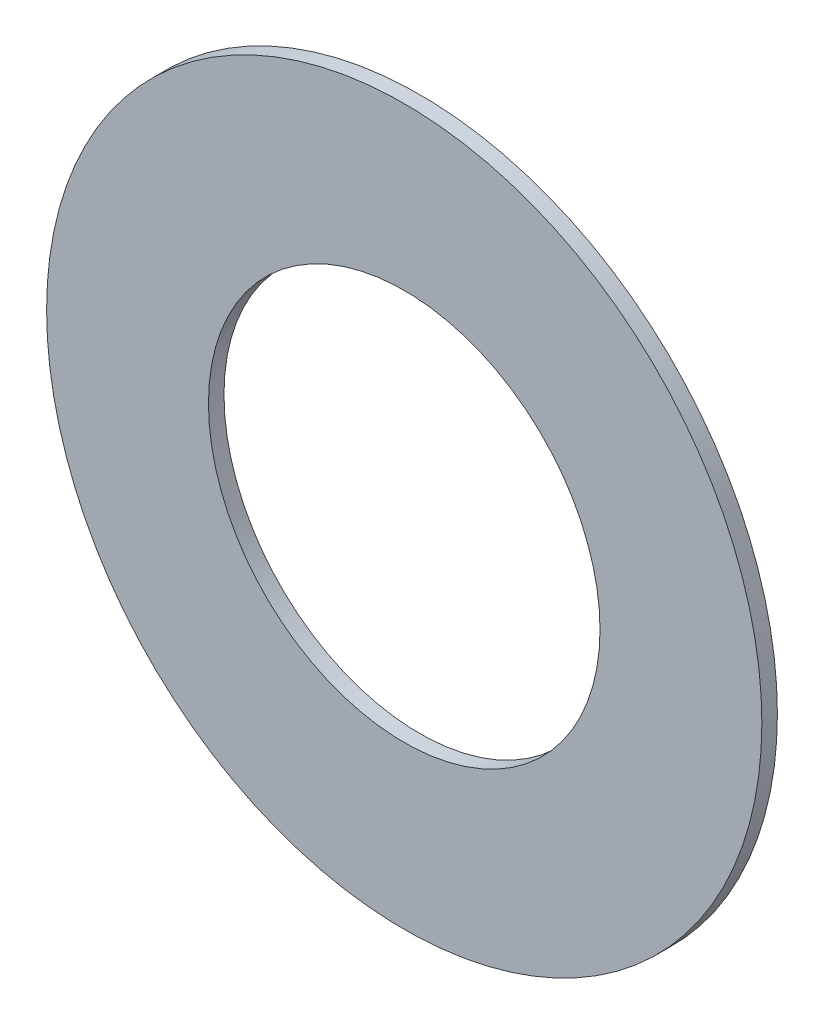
from build123d import *

# Parameters (mm, degrees)
SKETCH2_R           = 73.07437061
SKETCH2_R_2         = 40.005
BOSS_EXTRUDE1_DEPTH = 1.5875


with BuildPart() as part:
    # Sketch2 → Boss-Extrude1 (new, symmetric)
    with BuildSketch(Plane(origin=(0, 0, 0), x_dir=(0, 1, 0), z_dir=(0, 0, 1))):
        with Locations(Location((0, 0, 0), (0, 0, 270))):
            Circle(SKETCH2_R)
        with Locations(Location((0, 0, 0), (0, 0, 270))):
            Circle(SKETCH2_R_2, mode=Mode.SUBTRACT)
    extrude(amount=BOSS_EXTRUDE1_DEPTH, both=True)


solid = part.part
